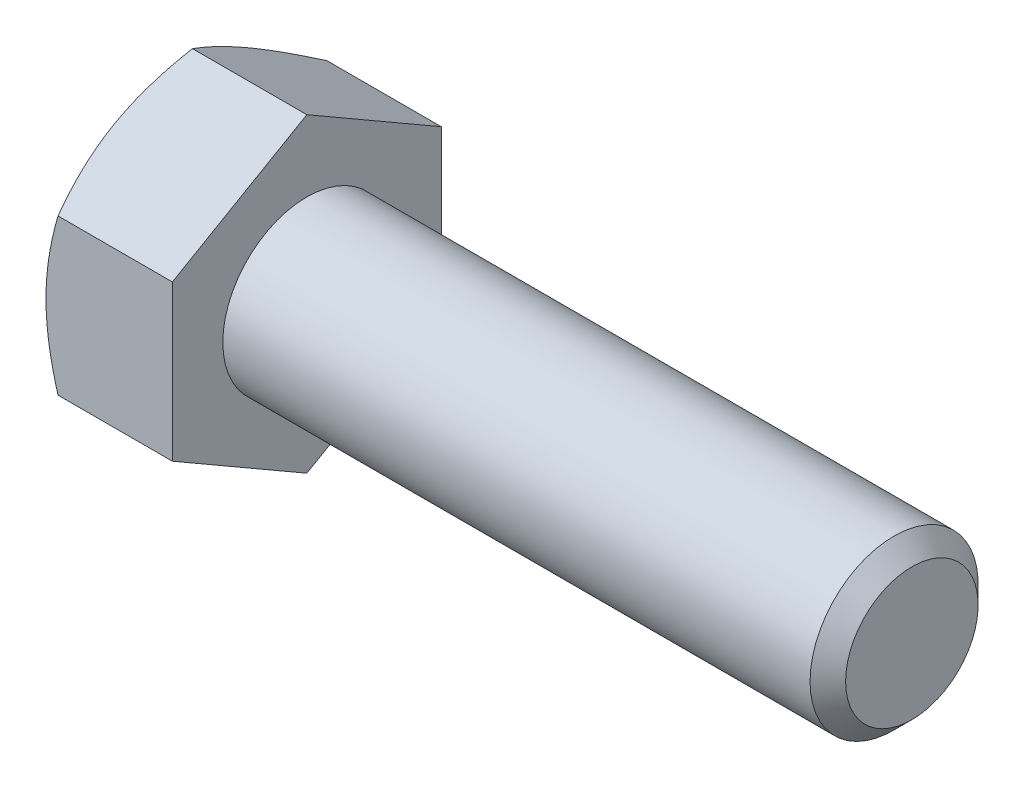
ISO-10303-21;
HEADER;
FILE_DESCRIPTION(('STEP AP214'),'2;1');
FILE_NAME('part.step','',(''),(''),'','','');
FILE_SCHEMA(('AUTOMOTIVE_DESIGN { 1 0 10303 214 1 1 1 1 }'));
ENDSEC;
DATA;
#1=APPLICATION_CONTEXT('core data for automotive mechanical design processes');
#2=APPLICATION_PROTOCOL_DEFINITION('international standard','automotive_design',2000,#1);
#3=PRODUCT_CONTEXT('',#1,'mechanical');
#4=PRODUCT('Part','Part','',(#3));
#5=PRODUCT_RELATED_PRODUCT_CATEGORY('part','',(#4));
#6=PRODUCT_DEFINITION_FORMATION('','',#4);
#7=PRODUCT_DEFINITION_CONTEXT('part definition',#1,'design');
#8=PRODUCT_DEFINITION('design','',#6,#7);
#9=PRODUCT_DEFINITION_SHAPE('','',#8);
#10=(LENGTH_UNIT() NAMED_UNIT(*) SI_UNIT(.MILLI.,.METRE.));
#11=(NAMED_UNIT(*) PLANE_ANGLE_UNIT() SI_UNIT($,.RADIAN.));
#12=(NAMED_UNIT(*) SI_UNIT($,.STERADIAN.) SOLID_ANGLE_UNIT());
#13=UNCERTAINTY_MEASURE_WITH_UNIT(LENGTH_MEASURE(1.E-05),#10,'distance_accuracy_value','');
#14=(GEOMETRIC_REPRESENTATION_CONTEXT(3) GLOBAL_UNCERTAINTY_ASSIGNED_CONTEXT((#13)) GLOBAL_UNIT_ASSIGNED_CONTEXT((#10,
#11,#12)) REPRESENTATION_CONTEXT('',''));
#15=CARTESIAN_POINT('',(0.,0.,0.));
#16=DIRECTION('',(0.,0.,1.));
#17=DIRECTION('',(1.,0.,0.));
#18=AXIS2_PLACEMENT_3D('',#15,#16,#17);
#19=CARTESIAN_POINT('',(5.969,3.66617420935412,-6.35));
#20=DIRECTION('',(0.,-0.866025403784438,0.500000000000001));
#21=DIRECTION('',(0.,-0.500000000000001,-0.866025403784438));
#22=AXIS2_PLACEMENT_3D('',#19,#20,#21);
#23=PLANE('',#22);
#24=CARTESIAN_POINT('',(0.567225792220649,7.33246388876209,0.0002));
#25=CARTESIAN_POINT('',(0.52070579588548,7.25187715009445,-0.13938032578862));
#26=CARTESIAN_POINT('',(0.476297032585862,7.17098994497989,-0.279481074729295));
#27=CARTESIAN_POINT('',(0.392283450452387,7.00855864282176,-0.560820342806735));
#28=CARTESIAN_POINT('',(0.352680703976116,6.92701427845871,-0.70205932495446));
#29=CARTESIAN_POINT('',(0.24185882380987,6.68107555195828,-1.12803769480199));
#30=CARTESIAN_POINT('',(0.178824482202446,6.51571038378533,-1.41445856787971));
#31=CARTESIAN_POINT('',(0.104909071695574,6.26824441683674,-1.84308219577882));
#32=CARTESIAN_POINT('',(0.0838526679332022,6.18688302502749,-1.98400426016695));
#33=CARTESIAN_POINT('',(0.0485440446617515,6.02379260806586,-2.26648514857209));
#34=CARTESIAN_POINT('',(0.0342912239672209,5.94206361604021,-2.40804391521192));
#35=CARTESIAN_POINT('',(0.0129530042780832,5.77846368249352,-2.69140731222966));
#36=CARTESIAN_POINT('',(0.00585947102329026,5.69659300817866,-2.83321147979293));
#37=CARTESIAN_POINT('',(-0.00101567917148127,5.53278054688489,-3.11694298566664));
#38=CARTESIAN_POINT('',(-0.000797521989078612,5.45083876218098,-3.2588703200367));
#39=CARTESIAN_POINT('',(0.00985057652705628,5.22634399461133,-3.64770666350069));
#40=CARTESIAN_POINT('',(0.0277266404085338,5.08386449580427,-3.89448839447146));
#41=CARTESIAN_POINT('',(0.0844122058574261,4.79985183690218,-4.38641274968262));
#42=CARTESIAN_POINT('',(0.123241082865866,4.65831967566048,-4.63155364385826));
#43=CARTESIAN_POINT('',(0.220302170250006,4.37373542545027,-5.12446802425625));
#44=CARTESIAN_POINT('',(0.278945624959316,4.23071924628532,-5.37217931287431));
#45=CARTESIAN_POINT('',(0.412042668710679,3.94681968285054,-5.86390778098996));
#46=CARTESIAN_POINT('',(0.486464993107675,3.80593266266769,-6.10793125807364));
#47=CARTESIAN_POINT('',(0.567225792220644,3.66605873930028,-6.3502));
#48=B_SPLINE_CURVE_WITH_KNOTS('',3,(#24,#25,#26,#27,#28,#29,#30,#31,#32,#33,#34,#35,#36,#37,#38,
#39,#40,#41,#42,#43,#44,#45,#46,#47),.UNSPECIFIED.,.F.,.F.,(4,2,2,2,2,2,2,2,2,2,2,4),(0.,
0.503218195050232,1.00665261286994,2.01561339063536,2.50773694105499,2.99981699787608,
3.49133733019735,3.9828424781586,4.83850206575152,5.69495425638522,6.57040160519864,
7.44413026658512),.UNSPECIFIED.);
#49=CARTESIAN_POINT('',(0.567159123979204,7.33234841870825,0.));
#50=VERTEX_POINT('',#49);
#51=CARTESIAN_POINT('',(0.,5.49926131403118,-3.17500000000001));
#52=VERTEX_POINT('',#51);
#53=EDGE_CURVE('E44',#50,#52,#48,.T.);
#54=ORIENTED_EDGE('',*,*,#53,.F.);
#55=DIRECTION('',(-1.,0.,0.));
#56=VECTOR('',#55,1.);
#57=CARTESIAN_POINT('',(5.969,7.33234841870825,0.));
#58=LINE('',#57,#56);
#59=CARTESIAN_POINT('',(5.969,7.33234841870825,0.));
#60=VERTEX_POINT('',#59);
#61=EDGE_CURVE('E140',#60,#50,#58,.T.);
#62=ORIENTED_EDGE('',*,*,#61,.F.);
#63=DIRECTION('',(0.,0.500000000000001,0.866025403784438));
#64=VECTOR('',#63,1.);
#65=CARTESIAN_POINT('',(5.969,3.66617420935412,-6.35));
#66=LINE('',#65,#64);
#67=CARTESIAN_POINT('',(5.969,3.66617420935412,-6.35));
#68=VERTEX_POINT('',#67);
#69=EDGE_CURVE('E225',#68,#60,#66,.T.);
#70=ORIENTED_EDGE('',*,*,#69,.F.);
#71=DIRECTION('',(-1.,0.,0.));
#72=VECTOR('',#71,1.);
#73=CARTESIAN_POINT('',(5.969,3.66617420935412,-6.35));
#74=LINE('',#73,#72);
#75=CARTESIAN_POINT('',(0.567159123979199,3.66617420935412,-6.35));
#76=VERTEX_POINT('',#75);
#77=EDGE_CURVE('E128',#68,#76,#74,.T.);
#78=ORIENTED_EDGE('',*,*,#77,.T.);
#79=EDGE_CURVE('E122',#52,#76,#48,.T.);
#80=ORIENTED_EDGE('',*,*,#79,.F.);
#81=EDGE_LOOP('',(#54,#62,#70,#78,#80));
#82=FACE_BOUND('',#81,.T.);
#83=ADVANCED_FACE('F28',(#82),#23,.F.);
#84=CARTESIAN_POINT('',(5.969,7.33234841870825,0.));
#85=DIRECTION('',(0.,-0.866025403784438,-0.500000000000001));
#86=DIRECTION('',(0.,0.500000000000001,-0.866025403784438));
#87=AXIS2_PLACEMENT_3D('',#84,#85,#86);
#88=PLANE('',#87);
#89=CARTESIAN_POINT('',(0.567225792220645,3.66605873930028,6.3502));
#90=CARTESIAN_POINT('',(0.520705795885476,3.74664547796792,6.21061967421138));
#91=CARTESIAN_POINT('',(0.476297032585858,3.82753268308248,6.0705189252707));
#92=CARTESIAN_POINT('',(0.392283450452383,3.9899639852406,5.78917965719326));
#93=CARTESIAN_POINT('',(0.352680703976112,4.07150834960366,5.64794067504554));
#94=CARTESIAN_POINT('',(0.241858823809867,4.31744707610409,5.22196230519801));
#95=CARTESIAN_POINT('',(0.178824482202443,4.48281224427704,4.93554143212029));
#96=CARTESIAN_POINT('',(0.104909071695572,4.73027821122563,4.50691780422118));
#97=CARTESIAN_POINT('',(0.0838526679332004,4.81163960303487,4.36599573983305));
#98=CARTESIAN_POINT('',(0.0485440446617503,4.9747300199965,4.08351485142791));
#99=CARTESIAN_POINT('',(0.0342912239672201,5.05645901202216,3.94195608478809));
#100=CARTESIAN_POINT('',(0.0129530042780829,5.22005894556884,3.65859268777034));
#101=CARTESIAN_POINT('',(0.00585947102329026,5.30192961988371,3.51678852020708));
#102=CARTESIAN_POINT('',(-0.00101567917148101,5.46574208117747,3.23305701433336));
#103=CARTESIAN_POINT('',(-0.000797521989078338,5.54768386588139,3.0911296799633));
#104=CARTESIAN_POINT('',(0.00985057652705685,5.77217863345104,2.70229333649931));
#105=CARTESIAN_POINT('',(0.0277266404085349,5.9146581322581,2.45551160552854));
#106=CARTESIAN_POINT('',(0.0844122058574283,6.19867079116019,1.96358725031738));
#107=CARTESIAN_POINT('',(0.123241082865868,6.34020295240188,1.71844635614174));
#108=CARTESIAN_POINT('',(0.220302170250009,6.6247872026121,1.22553197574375));
#109=CARTESIAN_POINT('',(0.27894562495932,6.76780338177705,0.977820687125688));
#110=CARTESIAN_POINT('',(0.412042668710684,7.05170294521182,0.486092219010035));
#111=CARTESIAN_POINT('',(0.486464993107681,7.19258996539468,0.242068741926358));
#112=CARTESIAN_POINT('',(0.56722579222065,7.33246388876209,-0.000200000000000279));
#113=B_SPLINE_CURVE_WITH_KNOTS('',3,(#89,#90,#91,#92,#93,#94,#95,#96,#97,#98,#99,#100,#101,#102,
#103,#104,#105,#106,#107,#108,#109,#110,#111,#112),.UNSPECIFIED.,.F.,.F.,(4,2,2,2,2,2,2,2,2,2,2,
4),(0.,0.503218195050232,1.00665261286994,2.01561339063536,2.50773694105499,2.99981699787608,
3.49133733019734,3.9828424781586,4.83850206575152,5.69495425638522,6.57040160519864,
7.44413026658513),.UNSPECIFIED.);
#114=CARTESIAN_POINT('',(0.5671591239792,3.66617420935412,6.35));
#115=VERTEX_POINT('',#114);
#116=CARTESIAN_POINT('',(0.,5.49926131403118,3.17500000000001));
#117=VERTEX_POINT('',#116);
#118=EDGE_CURVE('E51',#115,#117,#113,.T.);
#119=ORIENTED_EDGE('',*,*,#118,.F.);
#120=DIRECTION('',(-1.,0.,0.));
#121=VECTOR('',#120,1.);
#122=CARTESIAN_POINT('',(5.969,3.66617420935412,6.35));
#123=LINE('',#122,#121);
#124=CARTESIAN_POINT('',(5.969,3.66617420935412,6.35));
#125=VERTEX_POINT('',#124);
#126=EDGE_CURVE('E138',#125,#115,#123,.T.);
#127=ORIENTED_EDGE('',*,*,#126,.F.);
#128=DIRECTION('',(0.,-0.500000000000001,0.866025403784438));
#129=VECTOR('',#128,1.);
#130=CARTESIAN_POINT('',(5.969,7.33234841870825,0.));
#131=LINE('',#130,#129);
#132=EDGE_CURVE('E223',#60,#125,#131,.T.);
#133=ORIENTED_EDGE('',*,*,#132,.F.);
#134=ORIENTED_EDGE('',*,*,#61,.T.);
#135=EDGE_CURVE('E155',#117,#50,#113,.T.);
#136=ORIENTED_EDGE('',*,*,#135,.F.);
#137=EDGE_LOOP('',(#119,#127,#133,#134,#136));
#138=FACE_BOUND('',#137,.T.);
#139=ADVANCED_FACE('F161',(#138),#88,.F.);
#140=CARTESIAN_POINT('',(5.969,3.66617420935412,6.35));
#141=DIRECTION('',(0.,0.,-1.));
#142=DIRECTION('',(-1.,0.,0.));
#143=AXIS2_PLACEMENT_3D('',#140,#141,#142);
#144=PLANE('',#143);
#145=CARTESIAN_POINT('',(3.14367601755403,-9.93980283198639,6.35));
#146=CARTESIAN_POINT('',(3.0083719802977,-9.66163438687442,6.35));
#147=CARTESIAN_POINT('',(2.87433908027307,-9.3828371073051,6.35));
#148=CARTESIAN_POINT('',(2.60952879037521,-8.8236507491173,6.35));
#149=CARTESIAN_POINT('',(2.47875189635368,-8.54326143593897,6.35));
#150=CARTESIAN_POINT('',(2.22052868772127,-7.97915634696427,6.35));
#151=CARTESIAN_POINT('',(2.09310359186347,-7.695430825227,6.35));
#152=CARTESIAN_POINT('',(1.84334767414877,-7.12575465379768,6.35));
#153=CARTESIAN_POINT('',(1.72101661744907,-6.83980410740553,6.35));
#154=CARTESIAN_POINT('',(1.4788519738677,-6.2557230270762,6.35));
#155=CARTESIAN_POINT('',(1.35923464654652,-5.95750234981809,6.35));
#156=CARTESIAN_POINT('',(1.12883238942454,-5.357606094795,6.35));
#157=CARTESIAN_POINT('',(1.01804843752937,-5.05593013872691,6.35));
#158=CARTESIAN_POINT('',(0.808153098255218,-4.44917964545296,6.35));
#159=CARTESIAN_POINT('',(0.709018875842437,-4.14411308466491,6.35));
#160=CARTESIAN_POINT('',(0.525543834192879,-3.52960171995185,6.35));
#161=CARTESIAN_POINT('',(0.441198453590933,-3.22015829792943,6.35));
#162=CARTESIAN_POINT('',(0.291727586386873,-2.59842911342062,6.35));
#163=CARTESIAN_POINT('',(0.226496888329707,-2.2861690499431,6.35));
#164=CARTESIAN_POINT('',(0.118904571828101,-1.65762730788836,6.35));
#165=CARTESIAN_POINT('',(0.0765405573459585,-1.34134605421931,6.35));
#166=CARTESIAN_POINT('',(0.0329533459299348,-0.867275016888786,6.35));
#167=CARTESIAN_POINT('',(0.0217606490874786,-0.710363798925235,6.35));
#168=CARTESIAN_POINT('',(0.00601970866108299,-0.396201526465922,6.35));
#169=CARTESIAN_POINT('',(0.00147135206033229,-0.238950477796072,6.35));
#170=CARTESIAN_POINT('',(-0.000864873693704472,0.0756024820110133,6.35));
#171=CARTESIAN_POINT('',(0.00134730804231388,0.232904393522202,6.35));
#172=CARTESIAN_POINT('',(0.0124750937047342,0.547273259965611,6.35));
#173=CARTESIAN_POINT('',(0.0213910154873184,0.704340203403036,6.35));
#174=CARTESIAN_POINT('',(0.0504634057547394,1.07899586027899,6.35));
#175=CARTESIAN_POINT('',(0.0736436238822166,1.2963550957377,6.35));
#176=CARTESIAN_POINT('',(0.131599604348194,1.72951065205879,6.35));
#177=CARTESIAN_POINT('',(0.166376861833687,1.94530676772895,6.35));
#178=CARTESIAN_POINT('',(0.286264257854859,2.59006925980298,6.35));
#179=CARTESIAN_POINT('',(0.386910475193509,3.016187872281,6.35));
#180=CARTESIAN_POINT('',(0.562116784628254,3.65361272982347,6.35));
#181=CARTESIAN_POINT('',(0.625415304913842,3.86820484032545,6.35));
#182=CARTESIAN_POINT('',(0.758751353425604,4.29530575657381,6.35));
#183=CARTESIAN_POINT('',(0.828788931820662,4.50781454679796,6.35));
#184=CARTESIAN_POINT('',(0.974465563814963,4.93081468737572,6.35));
#185=CARTESIAN_POINT('',(1.05010294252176,5.14130661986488,6.35));
#186=CARTESIAN_POINT('',(1.20607264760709,5.56053331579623,6.35));
#187=CARTESIAN_POINT('',(1.2864048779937,5.76926811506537,6.35));
#188=CARTESIAN_POINT('',(1.50347781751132,6.31783828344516,6.35));
#189=CARTESIAN_POINT('',(1.64351404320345,6.65636817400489,6.35));
#190=CARTESIAN_POINT('',(1.93147973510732,7.33006601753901,6.35));
#191=CARTESIAN_POINT('',(2.07940998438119,7.66523363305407,6.35));
#192=CARTESIAN_POINT('',(2.38134633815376,8.33295246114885,6.35));
#193=CARTESIAN_POINT('',(2.53535453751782,8.66550272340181,6.35));
#194=CARTESIAN_POINT('',(2.84803388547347,9.3283820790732,6.35));
#195=CARTESIAN_POINT('',(3.00670486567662,9.65871125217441,6.35));
#196=CARTESIAN_POINT('',(3.32795966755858,10.3180684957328,6.35));
#197=CARTESIAN_POINT('',(3.49054898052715,10.6470938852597,6.35));
#198=CARTESIAN_POINT('',(3.81866781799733,11.3036759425,6.35));
#199=CARTESIAN_POINT('',(3.98419736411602,11.6312325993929,6.35));
#200=CARTESIAN_POINT('',(4.31759864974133,12.2850676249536,6.35));
#201=CARTESIAN_POINT('',(4.48546991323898,12.6113462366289,6.35));
#202=CARTESIAN_POINT('',(4.82315890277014,13.2628952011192,6.35));
#203=CARTESIAN_POINT('',(4.99297663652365,13.5881655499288,6.35));
#204=CARTESIAN_POINT('',(5.47018031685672,14.4967378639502,6.35));
#205=CARTESIAN_POINT('',(5.77935148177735,15.0791020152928,6.35));
#206=CARTESIAN_POINT('',(6.40147296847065,16.2418453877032,6.35));
#207=CARTESIAN_POINT('',(6.71442349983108,16.8222244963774,6.35));
#208=CARTESIAN_POINT('',(7.34215184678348,17.9796171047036,6.35));
#209=CARTESIAN_POINT('',(7.65692074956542,18.5566354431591,6.35));
#210=CARTESIAN_POINT('',(8.28862904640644,19.7094283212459,6.35));
#211=CARTESIAN_POINT('',(8.60556827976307,20.2852029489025,6.35));
#212=CARTESIAN_POINT('',(8.92329906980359,20.8605372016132,6.35));
#213=B_SPLINE_CURVE_WITH_KNOTS('',3,(#145,#146,#147,#148,#149,#150,#151,#152,#153,#154,#155,
#156,#157,#158,#159,#160,#161,#162,#163,#164,#165,#166,#167,#168,#169,#170,#171,#172,#173,#174,
#175,#176,#177,#178,#179,#180,#181,#182,#183,#184,#185,#186,#187,#188,#189,#190,#191,#192,#193,
#194,#195,#196,#197,#198,#199,#200,#201,#202,#203,#204,#205,#206,#207,#208,#209,#210,#211,#212),
.UNSPECIFIED.,.F.,.F.,(4,2,2,2,2,2,2,2,2,2,2,2,2,2,2,2,2,2,2,2,2,2,2,2,2,2,2,2,2,2,2,2,2,4),(0.,
0.928000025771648,1.85614052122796,2.78917912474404,3.72217466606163,4.68601414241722,
5.64996017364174,6.61198406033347,7.57371070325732,8.53003982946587,9.48626872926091,
9.95807916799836,10.4298815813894,10.9016875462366,11.3735158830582,12.0289230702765,
12.6844147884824,13.9960635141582,14.667204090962,15.338349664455,16.0092953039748,
16.6802272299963,17.7791313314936,18.8781446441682,19.9775401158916,21.0768959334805,
22.1778940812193,23.2789003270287,24.379685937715,25.480475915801,27.4584871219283,
29.4366085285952,31.408472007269,33.380191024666),.UNSPECIFIED.);
#214=CARTESIAN_POINT('',(0.567159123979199,-3.66617420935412,6.35));
#215=VERTEX_POINT('',#214);
#216=CARTESIAN_POINT('',(0.,0.,6.35));
#217=VERTEX_POINT('',#216);
#218=EDGE_CURVE('E235',#215,#217,#213,.T.);
#219=ORIENTED_EDGE('',*,*,#218,.F.);
#220=DIRECTION('',(-1.,0.,0.));
#221=VECTOR('',#220,1.);
#222=CARTESIAN_POINT('',(5.969,-3.66617420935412,6.35));
#223=LINE('',#222,#221);
#224=CARTESIAN_POINT('',(5.969,-3.66617420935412,6.35));
#225=VERTEX_POINT('',#224);
#226=EDGE_CURVE('E130',#225,#215,#223,.T.);
#227=ORIENTED_EDGE('',*,*,#226,.F.);
#228=DIRECTION('',(0.,-1.,0.));
#229=VECTOR('',#228,1.);
#230=CARTESIAN_POINT('',(5.969,3.66617420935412,6.35));
#231=LINE('',#230,#229);
#232=EDGE_CURVE('E219',#125,#225,#231,.T.);
#233=ORIENTED_EDGE('',*,*,#232,.F.);
#234=ORIENTED_EDGE('',*,*,#126,.T.);
#235=EDGE_CURVE('E177',#217,#115,#213,.T.);
#236=ORIENTED_EDGE('',*,*,#235,.F.);
#237=EDGE_LOOP('',(#219,#227,#233,#234,#236));
#238=FACE_BOUND('',#237,.T.);
#239=ADVANCED_FACE('F241',(#238),#144,.F.);
#240=CARTESIAN_POINT('',(5.969,-7.33234841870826,0.));
#241=DIRECTION('',(0.,0.866025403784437,-0.500000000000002));
#242=DIRECTION('',(0.,0.500000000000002,0.866025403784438));
#243=AXIS2_PLACEMENT_3D('',#240,#241,#242);
#244=PLANE('',#243);
#245=CARTESIAN_POINT('',(0.567225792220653,-7.3324638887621,-0.000200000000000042));
#246=CARTESIAN_POINT('',(0.520705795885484,-7.25187715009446,0.13938032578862));
#247=CARTESIAN_POINT('',(0.476297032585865,-7.17098994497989,0.279481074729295));
#248=CARTESIAN_POINT('',(0.39228345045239,-7.00855864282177,0.560820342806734));
#249=CARTESIAN_POINT('',(0.352680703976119,-6.92701427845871,0.70205932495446));
#250=CARTESIAN_POINT('',(0.241858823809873,-6.68107555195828,1.12803769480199));
#251=CARTESIAN_POINT('',(0.178824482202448,-6.51571038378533,1.41445856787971));
#252=CARTESIAN_POINT('',(0.104909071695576,-6.26824441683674,1.84308219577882));
#253=CARTESIAN_POINT('',(0.0838526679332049,-6.1868830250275,1.98400426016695));
#254=CARTESIAN_POINT('',(0.048544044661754,-6.02379260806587,2.26648514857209));
#255=CARTESIAN_POINT('',(0.034291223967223,-5.94206361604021,2.40804391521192));
#256=CARTESIAN_POINT('',(0.0129530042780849,-5.77846368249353,2.69140731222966));
#257=CARTESIAN_POINT('',(0.00585947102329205,-5.69659300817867,2.83321147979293));
#258=CARTESIAN_POINT('',(-0.00101567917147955,-5.5327805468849,3.11694298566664));
#259=CARTESIAN_POINT('',(-0.000797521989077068,-5.45083876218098,3.2588703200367));
#260=CARTESIAN_POINT('',(0.00985057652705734,-5.22634399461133,3.64770666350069));
#261=CARTESIAN_POINT('',(0.0277266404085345,-5.08386449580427,3.89448839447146));
#262=CARTESIAN_POINT('',(0.0844122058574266,-4.79985183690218,4.38641274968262));
#263=CARTESIAN_POINT('',(0.123241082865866,-4.65831967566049,4.63155364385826));
#264=CARTESIAN_POINT('',(0.220302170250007,-4.37373542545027,5.12446802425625));
#265=CARTESIAN_POINT('',(0.278945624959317,-4.23071924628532,5.37217931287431));
#266=CARTESIAN_POINT('',(0.41204266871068,-3.94681968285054,5.86390778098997));
#267=CARTESIAN_POINT('',(0.486464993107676,-3.80593266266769,6.10793125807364));
#268=CARTESIAN_POINT('',(0.567225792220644,-3.66605873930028,6.3502));
#269=B_SPLINE_CURVE_WITH_KNOTS('',3,(#245,#246,#247,#248,#249,#250,#251,#252,#253,#254,#255,
#256,#257,#258,#259,#260,#261,#262,#263,#264,#265,#266,#267,#268),.UNSPECIFIED.,.F.,.F.,(4,2,2,
2,2,2,2,2,2,2,2,4),(0.,0.503218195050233,1.00665261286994,2.01561339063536,2.50773694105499,
2.99981699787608,3.49133733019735,3.9828424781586,4.83850206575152,5.69495425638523,
6.57040160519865,7.44413026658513),.UNSPECIFIED.);
#270=CARTESIAN_POINT('',(0.567159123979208,-7.33234841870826,0.));
#271=VERTEX_POINT('',#270);
#272=CARTESIAN_POINT('',(0.,-5.49926131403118,3.17500000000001));
#273=VERTEX_POINT('',#272);
#274=EDGE_CURVE('E163',#271,#273,#269,.T.);
#275=ORIENTED_EDGE('',*,*,#274,.F.);
#276=DIRECTION('',(-1.,0.,0.));
#277=VECTOR('',#276,1.);
#278=CARTESIAN_POINT('',(5.969,-7.33234841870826,0.));
#279=LINE('',#278,#277);
#280=CARTESIAN_POINT('',(5.969,-7.33234841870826,0.));
#281=VERTEX_POINT('',#280);
#282=EDGE_CURVE('E127',#281,#271,#279,.T.);
#283=ORIENTED_EDGE('',*,*,#282,.F.);
#284=DIRECTION('',(0.,-0.500000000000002,-0.866025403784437));
#285=VECTOR('',#284,1.);
#286=CARTESIAN_POINT('',(5.969,-7.33234841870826,0.));
#287=LINE('',#286,#285);
#288=EDGE_CURVE('E217',#225,#281,#287,.T.);
#289=ORIENTED_EDGE('',*,*,#288,.F.);
#290=ORIENTED_EDGE('',*,*,#226,.T.);
#291=EDGE_CURVE('E165',#273,#215,#269,.T.);
#292=ORIENTED_EDGE('',*,*,#291,.F.);
#293=EDGE_LOOP('',(#275,#283,#289,#290,#292));
#294=FACE_BOUND('',#293,.T.);
#295=ADVANCED_FACE('F213',(#294),#244,.F.);
#296=CARTESIAN_POINT('',(5.969,-3.66617420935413,-6.35));
#297=DIRECTION('',(0.,0.866025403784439,0.5));
#298=DIRECTION('',(0.,-0.5,0.866025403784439));
#299=AXIS2_PLACEMENT_3D('',#296,#297,#298);
#300=PLANE('',#299);
#301=CARTESIAN_POINT('',(0.567225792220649,-3.66605873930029,-6.3502));
#302=CARTESIAN_POINT('',(0.52070579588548,-3.74664547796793,-6.21061967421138));
#303=CARTESIAN_POINT('',(0.476297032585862,-3.8275326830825,-6.0705189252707));
#304=CARTESIAN_POINT('',(0.392283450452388,-3.98996398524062,-5.78917965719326));
#305=CARTESIAN_POINT('',(0.352680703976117,-4.07150834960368,-5.64794067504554));
#306=CARTESIAN_POINT('',(0.241858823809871,-4.31744707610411,-5.22196230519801));
#307=CARTESIAN_POINT('',(0.178824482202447,-4.48281224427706,-4.93554143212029));
#308=CARTESIAN_POINT('',(0.104909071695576,-4.73027821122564,-4.50691780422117));
#309=CARTESIAN_POINT('',(0.0838526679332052,-4.81163960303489,-4.36599573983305));
#310=CARTESIAN_POINT('',(0.0485440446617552,-4.97473001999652,-4.08351485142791));
#311=CARTESIAN_POINT('',(0.034291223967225,-5.05645901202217,-3.94195608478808));
#312=CARTESIAN_POINT('',(0.0129530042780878,-5.22005894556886,-3.65859268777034));
#313=CARTESIAN_POINT('',(0.00585947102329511,-5.30192961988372,-3.51678852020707));
#314=CARTESIAN_POINT('',(-0.00101567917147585,-5.46574208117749,-3.23305701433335));
#315=CARTESIAN_POINT('',(-0.000797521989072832,-5.5476838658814,-3.0911296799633));
#316=CARTESIAN_POINT('',(0.00985057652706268,-5.77217863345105,-2.70229333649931));
#317=CARTESIAN_POINT('',(0.0277266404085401,-5.91465813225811,-2.45551160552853));
#318=CARTESIAN_POINT('',(0.0844122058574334,-6.1986707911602,-1.96358725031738));
#319=CARTESIAN_POINT('',(0.123241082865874,-6.34020295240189,-1.71844635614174));
#320=CARTESIAN_POINT('',(0.220302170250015,-6.62478720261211,-1.22553197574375));
#321=CARTESIAN_POINT('',(0.278945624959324,-6.76780338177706,-0.977820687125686));
#322=CARTESIAN_POINT('',(0.412042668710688,-7.05170294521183,-0.486092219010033));
#323=CARTESIAN_POINT('',(0.486464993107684,-7.19258996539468,-0.242068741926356));
#324=CARTESIAN_POINT('',(0.567225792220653,-7.3324638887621,0.000200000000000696));
#325=B_SPLINE_CURVE_WITH_KNOTS('',3,(#301,#302,#303,#304,#305,#306,#307,#308,#309,#310,#311,
#312,#313,#314,#315,#316,#317,#318,#319,#320,#321,#322,#323,#324),.UNSPECIFIED.,.F.,.F.,(4,2,2,
2,2,2,2,2,2,2,2,4),(0.,0.503218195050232,1.00665261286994,2.01561339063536,2.50773694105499,
2.99981699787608,3.49133733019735,3.9828424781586,4.83850206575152,5.69495425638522,
6.57040160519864,7.44413026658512),.UNSPECIFIED.);
#326=CARTESIAN_POINT('',(0.56715912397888,-3.66617420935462,-6.35));
#327=VERTEX_POINT('',#326);
#328=CARTESIAN_POINT('',(0.,-5.49926131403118,-3.175));
#329=VERTEX_POINT('',#328);
#330=EDGE_CURVE('E104',#327,#329,#325,.T.);
#331=ORIENTED_EDGE('',*,*,#330,.F.);
#332=DIRECTION('',(-1.,0.,0.));
#333=VECTOR('',#332,1.);
#334=CARTESIAN_POINT('',(5.969,-3.66617420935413,-6.35));
#335=LINE('',#334,#333);
#336=CARTESIAN_POINT('',(5.969,-3.66617420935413,-6.35));
#337=VERTEX_POINT('',#336);
#338=EDGE_CURVE('E118',#337,#327,#335,.T.);
#339=ORIENTED_EDGE('',*,*,#338,.F.);
#340=DIRECTION('',(0.,0.5,-0.866025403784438));
#341=VECTOR('',#340,1.);
#342=CARTESIAN_POINT('',(5.969,-3.66617420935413,-6.35));
#343=LINE('',#342,#341);
#344=EDGE_CURVE('E215',#281,#337,#343,.T.);
#345=ORIENTED_EDGE('',*,*,#344,.F.);
#346=ORIENTED_EDGE('',*,*,#282,.T.);
#347=EDGE_CURVE('E121',#329,#271,#325,.T.);
#348=ORIENTED_EDGE('',*,*,#347,.F.);
#349=EDGE_LOOP('',(#331,#339,#345,#346,#348));
#350=FACE_BOUND('',#349,.T.);
#351=ADVANCED_FACE('F116',(#350),#300,.F.);
#352=CARTESIAN_POINT('',(5.969,3.66617420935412,-6.35));
#353=DIRECTION('',(0.,0.,1.));
#354=DIRECTION('',(0.,-1.,0.));
#355=AXIS2_PLACEMENT_3D('',#352,#353,#354);
#356=PLANE('',#355);
#357=CARTESIAN_POINT('',(3.1436760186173,-9.93980283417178,-6.35));
#358=CARTESIAN_POINT('',(3.00837198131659,-9.66163438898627,-6.35));
#359=CARTESIAN_POINT('',(2.87433908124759,-9.38283710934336,-6.35));
#360=CARTESIAN_POINT('',(2.60952879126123,-8.82365075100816,-6.35));
#361=CARTESIAN_POINT('',(2.47875189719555,-8.54326143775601,-6.35));
#362=CARTESIAN_POINT('',(2.22052868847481,-7.97915634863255,-6.35));
#363=CARTESIAN_POINT('',(2.09310359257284,-7.69543082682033,-6.35));
#364=CARTESIAN_POINT('',(1.84334767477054,-7.1257546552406,-6.35));
#365=CARTESIAN_POINT('',(1.7210166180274,-6.839804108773,-6.35));
#366=CARTESIAN_POINT('',(1.47885197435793,-6.25572302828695,-6.35));
#367=CARTESIAN_POINT('',(1.3592346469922,-5.95750235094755,-6.35));
#368=CARTESIAN_POINT('',(1.12883238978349,-5.35760609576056,-6.35));
#369=CARTESIAN_POINT('',(1.01804843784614,-5.05593013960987,-6.35));
#370=CARTESIAN_POINT('',(0.808153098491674,-4.44917964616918,-6.35));
#371=CARTESIAN_POINT('',(0.70901887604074,-4.14411308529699,-6.35));
#372=CARTESIAN_POINT('',(0.525543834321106,-3.52960172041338,-6.35));
#373=CARTESIAN_POINT('',(0.441198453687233,-3.22015829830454,-6.35));
#374=CARTESIAN_POINT('',(0.291727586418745,-2.59842911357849,-6.35));
#375=CARTESIAN_POINT('',(0.226496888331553,-2.28616904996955,-6.35));
#376=CARTESIAN_POINT('',(0.118904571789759,-1.65762730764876,-6.35));
#377=CARTESIAN_POINT('',(0.0765405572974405,-1.34134605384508,-6.35));
#378=CARTESIAN_POINT('',(0.0329533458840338,-0.867275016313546,-6.35));
#379=CARTESIAN_POINT('',(0.0217606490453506,-0.710363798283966,-6.35));
#380=CARTESIAN_POINT('',(0.00601970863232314,-0.396201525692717,-6.35));
#381=CARTESIAN_POINT('',(0.00147135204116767,-0.238950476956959,-6.35));
#382=CARTESIAN_POINT('',(-0.000864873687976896,0.0756024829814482,-6.35));
#383=CARTESIAN_POINT('',(0.0013473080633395,0.23290439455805,-6.35));
#384=CARTESIAN_POINT('',(0.0124750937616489,0.547273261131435,-6.35));
#385=CARTESIAN_POINT('',(0.0213910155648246,0.704340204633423,-6.35));
#386=CARTESIAN_POINT('',(0.0504634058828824,1.07899586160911,-6.35));
#387=CARTESIAN_POINT('',(0.0736436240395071,1.29635509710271,-6.35));
#388=CARTESIAN_POINT('',(0.131599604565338,1.72951065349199,-6.35));
#389=CARTESIAN_POINT('',(0.166376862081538,1.94530676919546,-6.35));
#390=CARTESIAN_POINT('',(0.286264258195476,2.59006926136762,-6.35));
#391=CARTESIAN_POINT('',(0.386910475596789,3.01618787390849,-6.35));
#392=CARTESIAN_POINT('',(0.562116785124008,3.65361273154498,-6.35));
#393=CARTESIAN_POINT('',(0.625415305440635,3.86820484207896,-6.35));
#394=CARTESIAN_POINT('',(0.758751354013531,4.29530575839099,-6.35));
#395=CARTESIAN_POINT('',(0.828788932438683,4.50781454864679,-6.35));
#396=CARTESIAN_POINT('',(0.974465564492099,4.93081468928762,-6.35));
#397=CARTESIAN_POINT('',(1.05010294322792,5.1413066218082,-6.35));
#398=CARTESIAN_POINT('',(1.20607264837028,5.56053331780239,-6.35));
#399=CARTESIAN_POINT('',(1.28640487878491,5.76926811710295,-6.35));
#400=CARTESIAN_POINT('',(1.50347781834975,6.31783828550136,-6.35));
#401=CARTESIAN_POINT('',(1.64351404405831,6.65636817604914,-6.35));
#402=CARTESIAN_POINT('',(1.93147973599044,7.33006601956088,-6.35));
#403=CARTESIAN_POINT('',(2.07940998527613,7.6652336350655,-6.35));
#404=CARTESIAN_POINT('',(2.38134633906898,8.33295246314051,-6.35));
#405=CARTESIAN_POINT('',(2.53535453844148,8.66550272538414,-6.35));
#406=CARTESIAN_POINT('',(2.8480338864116,9.32838208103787,-6.35));
#407=CARTESIAN_POINT('',(3.00670486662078,9.65871125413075,-6.35));
#408=CARTESIAN_POINT('',(3.3279596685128,10.3180684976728,-6.35));
#409=CARTESIAN_POINT('',(3.49054898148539,10.6470938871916,-6.35));
#410=CARTESIAN_POINT('',(3.81866781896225,11.3036759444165,-6.35));
#411=CARTESIAN_POINT('',(3.98419736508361,11.6312326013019,-6.35));
#412=CARTESIAN_POINT('',(4.31759865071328,12.2850676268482,-6.35));
#413=CARTESIAN_POINT('',(4.48546991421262,12.6113462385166,-6.35));
#414=CARTESIAN_POINT('',(4.82315890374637,13.2628952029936,-6.35));
#415=CARTESIAN_POINT('',(4.99297663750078,13.5881655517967,-6.35));
#416=CARTESIAN_POINT('',(5.47018031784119,14.4967378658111,-6.35));
#417=CARTESIAN_POINT('',(5.77935148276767,15.0791020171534,-6.35));
#418=CARTESIAN_POINT('',(6.40147296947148,16.241845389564,-6.35));
#419=CARTESIAN_POINT('',(6.71442350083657,16.8222244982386,-6.35));
#420=CARTESIAN_POINT('',(7.34215184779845,17.9796171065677,-6.35));
#421=CARTESIAN_POINT('',(7.65692075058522,18.5566354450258,-6.35));
#422=CARTESIAN_POINT('',(8.28862904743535,19.709428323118,-6.35));
#423=CARTESIAN_POINT('',(8.60556828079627,20.2852029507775,-6.35));
#424=CARTESIAN_POINT('',(8.92329907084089,20.8605372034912,-6.35));
#425=B_SPLINE_CURVE_WITH_KNOTS('',3,(#357,#358,#359,#360,#361,#362,#363,#364,#365,#366,#367,
#368,#369,#370,#371,#372,#373,#374,#375,#376,#377,#378,#379,#380,#381,#382,#383,#384,#385,#386,
#387,#388,#389,#390,#391,#392,#393,#394,#395,#396,#397,#398,#399,#400,#401,#402,#403,#404,#405,
#406,#407,#408,#409,#410,#411,#412,#413,#414,#415,#416,#417,#418,#419,#420,#421,#422,#423,#424),
.UNSPECIFIED.,.F.,.F.,(4,2,2,2,2,2,2,2,2,2,2,2,2,2,2,2,2,2,2,2,2,2,2,2,2,2,2,2,2,2,2,2,2,4),(0.,
0.928000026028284,1.85614052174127,2.78917912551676,3.72217466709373,4.68601414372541,
5.64996017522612,6.61198406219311,7.57371070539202,8.53003983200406,9.48626873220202,
9.95807917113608,10.4298815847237,10.9016875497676,11.373515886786,12.0289230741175,
12.6844147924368,13.9960635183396,14.6672040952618,15.3383496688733,16.0092953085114,
16.680227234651,17.7791313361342,18.8781446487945,19.9775401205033,21.0768959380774,
22.1778940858,23.2789003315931,24.3796859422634,25.4804759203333,27.4584871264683,
29.4366085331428,31.4084720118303,33.3801910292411),.UNSPECIFIED.);
#426=CARTESIAN_POINT('',(0.,0.,-6.35));
#427=VERTEX_POINT('',#426);
#428=EDGE_CURVE('E110',#76,#427,#425,.F.);
#429=ORIENTED_EDGE('',*,*,#428,.F.);
#430=ORIENTED_EDGE('',*,*,#77,.F.);
#431=DIRECTION('',(0.,1.,0.));
#432=VECTOR('',#431,1.);
#433=CARTESIAN_POINT('',(5.969,3.66617420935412,-6.35));
#434=LINE('',#433,#432);
#435=EDGE_CURVE('E126',#337,#68,#434,.T.);
#436=ORIENTED_EDGE('',*,*,#435,.F.);
#437=ORIENTED_EDGE('',*,*,#338,.T.);
#438=EDGE_CURVE('E101',#427,#327,#425,.F.);
#439=ORIENTED_EDGE('',*,*,#438,.F.);
#440=EDGE_LOOP('',(#429,#430,#436,#437,#439));
#441=FACE_BOUND('',#440,.T.);
#442=ADVANCED_FACE('F124',(#441),#356,.F.);
#443=CARTESIAN_POINT('',(5.969,7.33234841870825,0.));
#444=DIRECTION('',(1.,0.,0.));
#445=DIRECTION('',(0.,0.,-1.));
#446=AXIS2_PLACEMENT_3D('',#443,#444,#445);
#447=PLANE('',#446);
#448=ORIENTED_EDGE('',*,*,#69,.T.);
#449=ORIENTED_EDGE('',*,*,#132,.T.);
#450=ORIENTED_EDGE('',*,*,#232,.T.);
#451=ORIENTED_EDGE('',*,*,#288,.T.);
#452=ORIENTED_EDGE('',*,*,#344,.T.);
#453=ORIENTED_EDGE('',*,*,#435,.T.);
#454=EDGE_LOOP('',(#448,#449,#450,#451,#452,#453));
#455=FACE_BOUND('',#454,.T.);
#456=CARTESIAN_POINT('',(5.969,0.,0.));
#457=DIRECTION('',(1.,0.,0.));
#458=DIRECTION('',(0.,0.,-1.));
#459=AXIS2_PLACEMENT_3D('',#456,#457,#458);
#460=CIRCLE('',#459,3.96875);
#461=CARTESIAN_POINT('',(5.969,0.,-3.96875));
#462=VERTEX_POINT('',#461);
#463=EDGE_CURVE('E228',#462,#462,#460,.F.);
#464=ORIENTED_EDGE('',*,*,#463,.T.);
#465=EDGE_LOOP('',(#464));
#466=FACE_BOUND('',#465,.T.);
#467=ADVANCED_FACE('F243',(#455,#466),#447,.T.);
#468=CARTESIAN_POINT('',(0.,0.,0.));
#469=DIRECTION('',(-1.,0.,0.));
#470=DIRECTION('',(0.,0.,1.));
#471=AXIS2_PLACEMENT_3D('',#468,#469,#470);
#472=CYLINDRICAL_SURFACE('',#471,3.96875);
#473=ORIENTED_EDGE('',*,*,#463,.F.);
#474=EDGE_LOOP('',(#473));
#475=FACE_BOUND('',#474,.T.);
#476=CARTESIAN_POINT('',(33.70453,0.,0.));
#477=DIRECTION('',(-1.,0.,0.));
#478=DIRECTION('',(0.,0.,1.));
#479=AXIS2_PLACEMENT_3D('',#476,#477,#478);
#480=CIRCLE('',#479,3.96875);
#481=CARTESIAN_POINT('',(33.70453,0.,3.96875));
#482=VERTEX_POINT('',#481);
#483=EDGE_CURVE('E231',#482,#482,#480,.T.);
#484=ORIENTED_EDGE('',*,*,#483,.T.);
#485=EDGE_LOOP('',(#484));
#486=FACE_BOUND('',#485,.T.);
#487=ADVANCED_FACE('F275',(#475,#486),#472,.T.);
#488=CARTESIAN_POINT('',(34.544,0.,0.));
#489=DIRECTION('',(-1.,0.,0.));
#490=DIRECTION('',(0.,0.,1.));
#491=AXIS2_PLACEMENT_3D('',#488,#489,#490);
#492=CONICAL_SURFACE('',#491,3.12928,0.785398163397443);
#493=ORIENTED_EDGE('',*,*,#483,.F.);
#494=EDGE_LOOP('',(#493));
#495=FACE_BOUND('',#494,.T.);
#496=CARTESIAN_POINT('',(34.544,0.,0.));
#497=DIRECTION('',(-1.,0.,0.));
#498=DIRECTION('',(0.,0.,1.));
#499=AXIS2_PLACEMENT_3D('',#496,#497,#498);
#500=CIRCLE('',#499,3.12928);
#501=CARTESIAN_POINT('',(34.544,0.,3.12928));
#502=VERTEX_POINT('',#501);
#503=EDGE_CURVE('E233',#502,#502,#500,.T.);
#504=ORIENTED_EDGE('',*,*,#503,.T.);
#505=EDGE_LOOP('',(#504));
#506=FACE_BOUND('',#505,.T.);
#507=ADVANCED_FACE('F278',(#495,#506),#492,.T.);
#508=CARTESIAN_POINT('',(34.544,0.,0.));
#509=DIRECTION('',(-1.,0.,0.));
#510=DIRECTION('',(0.,0.,1.));
#511=AXIS2_PLACEMENT_3D('',#508,#509,#510);
#512=PLANE('',#511);
#513=ORIENTED_EDGE('',*,*,#503,.F.);
#514=EDGE_LOOP('',(#513));
#515=FACE_BOUND('',#514,.T.);
#516=ADVANCED_FACE('F190',(#515),#512,.F.);
#517=CARTESIAN_POINT('',(0.,0.,0.));
#518=DIRECTION('',(1.,0.,0.));
#519=DIRECTION('',(0.,0.,-1.));
#520=AXIS2_PLACEMENT_3D('',#517,#518,#519);
#521=CONICAL_SURFACE('',#520,6.35,1.0471975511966);
#522=ORIENTED_EDGE('',*,*,#330,.T.);
#523=CARTESIAN_POINT('',(0.,0.,0.));
#524=DIRECTION('',(1.,0.,0.));
#525=DIRECTION('',(0.,0.,-1.));
#526=AXIS2_PLACEMENT_3D('',#523,#524,#525);
#527=CIRCLE('',#526,6.35);
#528=EDGE_CURVE('E32',#329,#427,#527,.T.);
#529=ORIENTED_EDGE('',*,*,#528,.T.);
#530=ORIENTED_EDGE('',*,*,#438,.T.);
#531=EDGE_LOOP('',(#522,#529,#530));
#532=FACE_BOUND('',#531,.T.);
#533=ADVANCED_FACE('F103',(#532),#521,.T.);
#534=ORIENTED_EDGE('',*,*,#274,.T.);
#535=EDGE_CURVE('E145',#273,#329,#527,.T.);
#536=ORIENTED_EDGE('',*,*,#535,.T.);
#537=ORIENTED_EDGE('',*,*,#347,.T.);
#538=EDGE_LOOP('',(#534,#536,#537));
#539=FACE_BOUND('',#538,.T.);
#540=ADVANCED_FACE('F189',(#539),#521,.T.);
#541=ORIENTED_EDGE('',*,*,#218,.T.);
#542=EDGE_CURVE('E146',#217,#273,#527,.T.);
#543=ORIENTED_EDGE('',*,*,#542,.T.);
#544=ORIENTED_EDGE('',*,*,#291,.T.);
#545=EDGE_LOOP('',(#541,#543,#544));
#546=FACE_BOUND('',#545,.T.);
#547=ADVANCED_FACE('F184',(#546),#521,.T.);
#548=ORIENTED_EDGE('',*,*,#235,.T.);
#549=ORIENTED_EDGE('',*,*,#118,.T.);
#550=CARTESIAN_POINT('',(0.,0.,0.));
#551=DIRECTION('',(-1.,0.,0.));
#552=DIRECTION('',(0.,0.,1.));
#553=AXIS2_PLACEMENT_3D('',#550,#551,#552);
#554=CIRCLE('',#553,6.35);
#555=EDGE_CURVE('E111',#217,#117,#554,.T.);
#556=ORIENTED_EDGE('',*,*,#555,.F.);
#557=EDGE_LOOP('',(#548,#549,#556));
#558=FACE_BOUND('',#557,.T.);
#559=ADVANCED_FACE('F188',(#558),#521,.T.);
#560=ORIENTED_EDGE('',*,*,#135,.T.);
#561=ORIENTED_EDGE('',*,*,#53,.T.);
#562=EDGE_CURVE('E37',#52,#117,#527,.T.);
#563=ORIENTED_EDGE('',*,*,#562,.T.);
#564=EDGE_LOOP('',(#560,#561,#563));
#565=FACE_BOUND('',#564,.T.);
#566=ADVANCED_FACE('F154',(#565),#521,.T.);
#567=ORIENTED_EDGE('',*,*,#79,.T.);
#568=ORIENTED_EDGE('',*,*,#428,.T.);
#569=EDGE_CURVE('E11',#427,#52,#527,.T.);
#570=ORIENTED_EDGE('',*,*,#569,.T.);
#571=EDGE_LOOP('',(#567,#568,#570));
#572=FACE_BOUND('',#571,.T.);
#573=ADVANCED_FACE('F247',(#572),#521,.T.);
#574=CARTESIAN_POINT('',(0.,7.33234841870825,0.));
#575=DIRECTION('',(1.,0.,0.));
#576=DIRECTION('',(0.,0.,-1.));
#577=AXIS2_PLACEMENT_3D('',#574,#575,#576);
#578=PLANE('',#577);
#579=ORIENTED_EDGE('',*,*,#569,.F.);
#580=ORIENTED_EDGE('',*,*,#528,.F.);
#581=ORIENTED_EDGE('',*,*,#535,.F.);
#582=ORIENTED_EDGE('',*,*,#542,.F.);
#583=ORIENTED_EDGE('',*,*,#555,.T.);
#584=ORIENTED_EDGE('',*,*,#562,.F.);
#585=EDGE_LOOP('',(#579,#580,#581,#582,#583,#584));
#586=FACE_BOUND('',#585,.T.);
#587=ADVANCED_FACE('F158',(#586),#578,.F.);
#588=CLOSED_SHELL('',(#83,#139,#239,#295,#351,#442,#467,#487,#507,#516,#533,#540,#547,#559,#566,
#573,#587));
#589=MANIFOLD_SOLID_BREP('B2',#588);
#590=ADVANCED_BREP_SHAPE_REPRESENTATION('',(#18,#589),#14);
#591=SHAPE_DEFINITION_REPRESENTATION(#9,#590);
ENDSEC;
END-ISO-10303-21;
